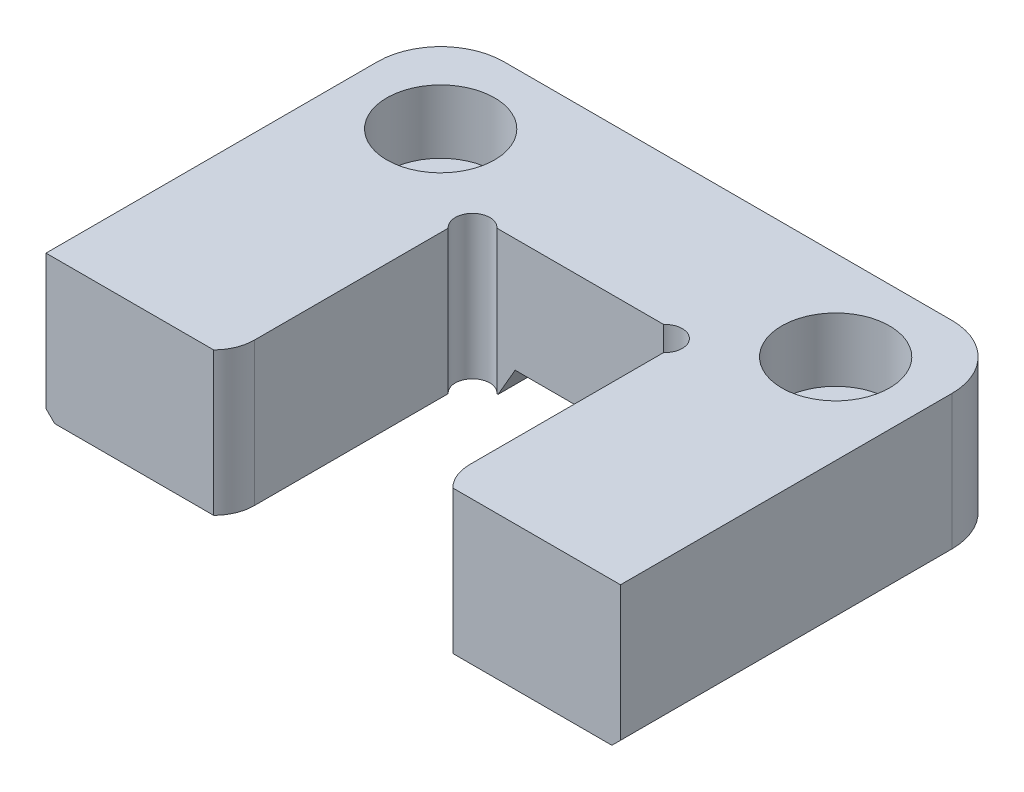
ISO-10303-21;
HEADER;
FILE_DESCRIPTION(('STEP AP214'),'2;1');
FILE_NAME('part.step','',(''),(''),'','','');
FILE_SCHEMA(('AUTOMOTIVE_DESIGN { 1 0 10303 214 1 1 1 1 }'));
ENDSEC;
DATA;
#1=APPLICATION_CONTEXT('core data for automotive mechanical design processes');
#2=APPLICATION_PROTOCOL_DEFINITION('international standard','automotive_design',2000,#1);
#3=PRODUCT_CONTEXT('',#1,'mechanical');
#4=PRODUCT('Part','Part','',(#3));
#5=PRODUCT_RELATED_PRODUCT_CATEGORY('part','',(#4));
#6=PRODUCT_DEFINITION_FORMATION('','',#4);
#7=PRODUCT_DEFINITION_CONTEXT('part definition',#1,'design');
#8=PRODUCT_DEFINITION('design','',#6,#7);
#9=PRODUCT_DEFINITION_SHAPE('','',#8);
#10=(LENGTH_UNIT() NAMED_UNIT(*) SI_UNIT(.MILLI.,.METRE.));
#11=(NAMED_UNIT(*) PLANE_ANGLE_UNIT() SI_UNIT($,.RADIAN.));
#12=(NAMED_UNIT(*) SI_UNIT($,.STERADIAN.) SOLID_ANGLE_UNIT());
#13=UNCERTAINTY_MEASURE_WITH_UNIT(LENGTH_MEASURE(1.E-05),#10,'distance_accuracy_value','');
#14=(GEOMETRIC_REPRESENTATION_CONTEXT(3) GLOBAL_UNCERTAINTY_ASSIGNED_CONTEXT((#13)) GLOBAL_UNIT_ASSIGNED_CONTEXT((#10,
#11,#12)) REPRESENTATION_CONTEXT('',''));
#15=CARTESIAN_POINT('',(0.,0.,0.));
#16=DIRECTION('',(0.,0.,1.));
#17=DIRECTION('',(1.,0.,0.));
#18=AXIS2_PLACEMENT_3D('',#15,#16,#17);
#19=CARTESIAN_POINT('',(-25.4,-12.6746,-34.8996));
#20=DIRECTION('',(0.,-1.,0.));
#21=DIRECTION('',(0.,0.,-1.));
#22=AXIS2_PLACEMENT_3D('',#19,#20,#21);
#23=PLANE('',#22);
#24=CARTESIAN_POINT('',(-17.4625,-12.6746,-26.9621));
#25=DIRECTION('',(0.,1.,0.));
#26=DIRECTION('',(0.,0.,1.));
#27=AXIS2_PLACEMENT_3D('',#24,#25,#26);
#28=CIRCLE('',#27,2.5527);
#29=CARTESIAN_POINT('',(-17.4625,-12.6746,-24.4094));
#30=VERTEX_POINT('',#29);
#31=EDGE_CURVE('E499',#30,#30,#28,.T.);
#32=ORIENTED_EDGE('',*,*,#31,.T.);
#33=EDGE_LOOP('',(#32));
#34=FACE_BOUND('',#33,.T.);
#35=CARTESIAN_POINT('',(-19.812,-12.6746,-29.3116));
#36=DIRECTION('',(0.,-1.,0.));
#37=DIRECTION('',(0.,0.,-1.));
#38=AXIS2_PLACEMENT_3D('',#35,#36,#37);
#39=CIRCLE('',#38,4.82599999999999);
#40=CARTESIAN_POINT('',(-24.638,-12.6746,-29.3116));
#41=VERTEX_POINT('',#40);
#42=CARTESIAN_POINT('',(-19.812,-12.6746,-34.1376));
#43=VERTEX_POINT('',#42);
#44=EDGE_CURVE('E343',#41,#43,#39,.T.);
#45=ORIENTED_EDGE('',*,*,#44,.T.);
#46=DIRECTION('',(1.,0.,0.));
#47=VECTOR('',#46,1.);
#48=CARTESIAN_POINT('',(-25.4,-12.6746,-34.1376));
#49=LINE('',#48,#47);
#50=CARTESIAN_POINT('',(-7.26654355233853,-12.6746,-34.1376));
#51=VERTEX_POINT('',#50);
#52=EDGE_CURVE('E345',#43,#51,#49,.T.);
#53=ORIENTED_EDGE('',*,*,#52,.T.);
#54=DIRECTION('',(0.,0.,-1.));
#55=VECTOR('',#54,1.);
#56=CARTESIAN_POINT('',(-7.26654355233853,-12.6746,-34.8996));
#57=LINE('',#56,#55);
#58=CARTESIAN_POINT('',(-7.26654355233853,-12.6746,-21.844));
#59=VERTEX_POINT('',#58);
#60=EDGE_CURVE('E320',#59,#51,#57,.T.);
#61=ORIENTED_EDGE('',*,*,#60,.F.);
#62=DIRECTION('',(1.,0.,0.));
#63=VECTOR('',#62,1.);
#64=CARTESIAN_POINT('',(-9.525,-12.6746,-21.844));
#65=LINE('',#64,#63);
#66=CARTESIAN_POINT('',(-7.37307746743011,-12.6746,-21.844));
#67=VERTEX_POINT('',#66);
#68=EDGE_CURVE('E271',#67,#59,#65,.T.);
#69=ORIENTED_EDGE('',*,*,#68,.F.);
#70=CARTESIAN_POINT('',(-8.509,-12.6746,-20.828));
#71=DIRECTION('',(0.,1.,0.));
#72=DIRECTION('',(0.,0.,1.));
#73=AXIS2_PLACEMENT_3D('',#70,#71,#72);
#74=CIRCLE('',#73,1.524);
#75=CARTESIAN_POINT('',(-9.525,-12.6746,-19.6920774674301));
#76=VERTEX_POINT('',#75);
#77=EDGE_CURVE('E233',#67,#76,#74,.T.);
#78=ORIENTED_EDGE('',*,*,#77,.T.);
#79=DIRECTION('',(0.,0.,-1.));
#80=VECTOR('',#79,1.);
#81=CARTESIAN_POINT('',(-9.525,-12.6746,0.));
#82=LINE('',#81,#80);
#83=CARTESIAN_POINT('',(-9.525,-12.6746,-2.54));
#84=VERTEX_POINT('',#83);
#85=EDGE_CURVE('E266',#84,#76,#82,.T.);
#86=ORIENTED_EDGE('',*,*,#85,.F.);
#87=CARTESIAN_POINT('',(-13.1163602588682,-12.6746,-2.54));
#88=DIRECTION('',(0.,-1.,0.));
#89=DIRECTION('',(0.,0.,1.));
#90=AXIS2_PLACEMENT_3D('',#87,#88,#89);
#91=CIRCLE('',#90,3.59136025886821);
#92=CARTESIAN_POINT('',(-10.577409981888,-12.6746,0.));
#93=VERTEX_POINT('',#92);
#94=EDGE_CURVE('E242',#84,#93,#91,.T.);
#95=ORIENTED_EDGE('',*,*,#94,.T.);
#96=DIRECTION('',(1.,0.,0.));
#97=VECTOR('',#96,1.);
#98=CARTESIAN_POINT('',(-25.4,-12.6746,0.));
#99=LINE('',#98,#97);
#100=CARTESIAN_POINT('',(-24.638,-12.6746,0.));
#101=VERTEX_POINT('',#100);
#102=EDGE_CURVE('E264',#101,#93,#99,.T.);
#103=ORIENTED_EDGE('',*,*,#102,.F.);
#104=DIRECTION('',(0.,0.,-1.));
#105=VECTOR('',#104,1.);
#106=CARTESIAN_POINT('',(-24.638,-12.6746,-34.8996));
#107=LINE('',#106,#105);
#108=EDGE_CURVE('E341',#101,#41,#107,.T.);
#109=ORIENTED_EDGE('',*,*,#108,.T.);
#110=EDGE_LOOP('',(#45,#53,#61,#69,#78,#86,#95,#103,#109));
#111=FACE_BOUND('',#110,.T.);
#112=ADVANCED_FACE('F35',(#34,#111),#23,.T.);
#113=CARTESIAN_POINT('',(-25.4,-12.6746,0.));
#114=DIRECTION('',(-1.,0.,0.));
#115=DIRECTION('',(0.,0.,1.));
#116=AXIS2_PLACEMENT_3D('',#113,#114,#115);
#117=PLANE('',#116);
#118=DIRECTION('',(0.,1.,0.));
#119=VECTOR('',#118,1.);
#120=CARTESIAN_POINT('',(-25.4,-12.6746,-29.3116));
#121=LINE('',#120,#119);
#122=CARTESIAN_POINT('',(-25.4,0.,-29.3116));
#123=VERTEX_POINT('',#122);
#124=CARTESIAN_POINT('',(-25.4,-11.9126,-29.3116));
#125=VERTEX_POINT('',#124);
#126=EDGE_CURVE('E312',#123,#125,#121,.F.);
#127=ORIENTED_EDGE('',*,*,#126,.T.);
#128=DIRECTION('',(0.,0.,1.));
#129=VECTOR('',#128,1.);
#130=CARTESIAN_POINT('',(-25.4,-11.9126,0.));
#131=LINE('',#130,#129);
#132=CARTESIAN_POINT('',(-25.4,-11.9126,0.));
#133=VERTEX_POINT('',#132);
#134=EDGE_CURVE('E350',#125,#133,#131,.T.);
#135=ORIENTED_EDGE('',*,*,#134,.T.);
#136=DIRECTION('',(0.,1.,0.));
#137=VECTOR('',#136,1.);
#138=CARTESIAN_POINT('',(-25.4,-12.6746,0.));
#139=LINE('',#138,#137);
#140=CARTESIAN_POINT('',(-25.4,0.,0.));
#141=VERTEX_POINT('',#140);
#142=EDGE_CURVE('E278',#133,#141,#139,.T.);
#143=ORIENTED_EDGE('',*,*,#142,.T.);
#144=DIRECTION('',(0.,0.,1.));
#145=VECTOR('',#144,1.);
#146=CARTESIAN_POINT('',(-25.4,0.,0.));
#147=LINE('',#146,#145);
#148=EDGE_CURVE('E256',#123,#141,#147,.T.);
#149=ORIENTED_EDGE('',*,*,#148,.F.);
#150=EDGE_LOOP('',(#127,#135,#143,#149));
#151=FACE_BOUND('',#150,.T.);
#152=ADVANCED_FACE('F425',(#151),#117,.T.);
#153=CARTESIAN_POINT('',(-25.4,-12.6746,-34.8996));
#154=DIRECTION('',(0.,0.,-1.));
#155=DIRECTION('',(-1.,0.,0.));
#156=AXIS2_PLACEMENT_3D('',#153,#154,#155);
#157=PLANE('',#156);
#158=DIRECTION('',(0.,1.,0.));
#159=VECTOR('',#158,1.);
#160=CARTESIAN_POINT('',(19.812,-12.6746,-34.8996));
#161=LINE('',#160,#159);
#162=CARTESIAN_POINT('',(19.812,0.,-34.8996));
#163=VERTEX_POINT('',#162);
#164=CARTESIAN_POINT('',(19.812,-11.9126,-34.8996));
#165=VERTEX_POINT('',#164);
#166=EDGE_CURVE('E310',#163,#165,#161,.F.);
#167=ORIENTED_EDGE('',*,*,#166,.T.);
#168=DIRECTION('',(-1.,0.,0.));
#169=VECTOR('',#168,1.);
#170=CARTESIAN_POINT('',(-25.4,-11.9126,-34.8996));
#171=LINE('',#170,#169);
#172=CARTESIAN_POINT('',(6.82660264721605,-11.9126,-34.8996));
#173=VERTEX_POINT('',#172);
#174=EDGE_CURVE('E335',#165,#173,#171,.T.);
#175=ORIENTED_EDGE('',*,*,#174,.T.);
#176=DIRECTION('',(0.499999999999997,-0.86602540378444,0.));
#177=VECTOR('',#176,1.);
#178=CARTESIAN_POINT('',(6.35,-11.0871,-34.8996));
#179=LINE('',#178,#177);
#180=CARTESIAN_POINT('',(6.35,-11.0871,-34.8996));
#181=VERTEX_POINT('',#180);
#182=EDGE_CURVE('E201',#181,#173,#179,.T.);
#183=ORIENTED_EDGE('',*,*,#182,.F.);
#184=DIRECTION('',(1.,0.,0.));
#185=VECTOR('',#184,1.);
#186=CARTESIAN_POINT('',(6.35,-11.0871,-34.8996));
#187=LINE('',#186,#185);
#188=CARTESIAN_POINT('',(-6.35,-11.0871,-34.8996));
#189=VERTEX_POINT('',#188);
#190=EDGE_CURVE('E195',#189,#181,#187,.T.);
#191=ORIENTED_EDGE('',*,*,#190,.F.);
#192=DIRECTION('',(0.499999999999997,0.86602540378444,0.));
#193=VECTOR('',#192,1.);
#194=CARTESIAN_POINT('',(-6.35,-11.0871,-34.8996));
#195=LINE('',#194,#193);
#196=CARTESIAN_POINT('',(-6.82660264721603,-11.9126,-34.8996));
#197=VERTEX_POINT('',#196);
#198=EDGE_CURVE('E204',#197,#189,#195,.T.);
#199=ORIENTED_EDGE('',*,*,#198,.F.);
#200=DIRECTION('',(-1.,0.,0.));
#201=VECTOR('',#200,1.);
#202=CARTESIAN_POINT('',(-25.4,-11.9126,-34.8996));
#203=LINE('',#202,#201);
#204=CARTESIAN_POINT('',(-19.812,-11.9126,-34.8996));
#205=VERTEX_POINT('',#204);
#206=EDGE_CURVE('E333',#197,#205,#203,.T.);
#207=ORIENTED_EDGE('',*,*,#206,.T.);
#208=DIRECTION('',(0.,1.,0.));
#209=VECTOR('',#208,1.);
#210=CARTESIAN_POINT('',(-19.812,-12.6746,-34.8996));
#211=LINE('',#210,#209);
#212=CARTESIAN_POINT('',(-19.812,0.,-34.8996));
#213=VERTEX_POINT('',#212);
#214=EDGE_CURVE('E308',#205,#213,#211,.T.);
#215=ORIENTED_EDGE('',*,*,#214,.T.);
#216=DIRECTION('',(-1.,0.,0.));
#217=VECTOR('',#216,1.);
#218=CARTESIAN_POINT('',(-25.4,0.,-34.8996));
#219=LINE('',#218,#217);
#220=EDGE_CURVE('E267',#163,#213,#219,.T.);
#221=ORIENTED_EDGE('',*,*,#220,.F.);
#222=EDGE_LOOP('',(#167,#175,#183,#191,#199,#207,#215,#221));
#223=FACE_BOUND('',#222,.T.);
#224=ADVANCED_FACE('F215',(#223),#157,.T.);
#225=CARTESIAN_POINT('',(25.4,-12.6746,0.));
#226=DIRECTION('',(1.,0.,0.));
#227=DIRECTION('',(0.,0.,-1.));
#228=AXIS2_PLACEMENT_3D('',#225,#226,#227);
#229=PLANE('',#228);
#230=DIRECTION('',(0.,1.,0.));
#231=VECTOR('',#230,1.);
#232=CARTESIAN_POINT('',(25.4,-12.6746,0.));
#233=LINE('',#232,#231);
#234=CARTESIAN_POINT('',(25.4,-11.9126,0.));
#235=VERTEX_POINT('',#234);
#236=CARTESIAN_POINT('',(25.4,0.,0.));
#237=VERTEX_POINT('',#236);
#238=EDGE_CURVE('E299',#235,#237,#233,.T.);
#239=ORIENTED_EDGE('',*,*,#238,.F.);
#240=DIRECTION('',(0.,0.,-1.));
#241=VECTOR('',#240,1.);
#242=CARTESIAN_POINT('',(25.4,-11.9126,0.));
#243=LINE('',#242,#241);
#244=CARTESIAN_POINT('',(25.4,-11.9126,-29.3116));
#245=VERTEX_POINT('',#244);
#246=EDGE_CURVE('E322',#235,#245,#243,.T.);
#247=ORIENTED_EDGE('',*,*,#246,.T.);
#248=DIRECTION('',(0.,1.,0.));
#249=VECTOR('',#248,1.);
#250=CARTESIAN_POINT('',(25.4,-12.6746,-29.3116));
#251=LINE('',#250,#249);
#252=CARTESIAN_POINT('',(25.4,0.,-29.3116));
#253=VERTEX_POINT('',#252);
#254=EDGE_CURVE('E301',#245,#253,#251,.T.);
#255=ORIENTED_EDGE('',*,*,#254,.T.);
#256=DIRECTION('',(0.,0.,-1.));
#257=VECTOR('',#256,1.);
#258=CARTESIAN_POINT('',(25.4,0.,0.));
#259=LINE('',#258,#257);
#260=EDGE_CURVE('E294',#237,#253,#259,.T.);
#261=ORIENTED_EDGE('',*,*,#260,.F.);
#262=EDGE_LOOP('',(#239,#247,#255,#261));
#263=FACE_BOUND('',#262,.T.);
#264=ADVANCED_FACE('F411',(#263),#229,.T.);
#265=CARTESIAN_POINT('',(9.525,-12.6746,0.));
#266=DIRECTION('',(0.,0.,1.));
#267=DIRECTION('',(1.,0.,0.));
#268=AXIS2_PLACEMENT_3D('',#265,#266,#267);
#269=PLANE('',#268);
#270=DIRECTION('',(1.,0.,0.));
#271=VECTOR('',#270,1.);
#272=CARTESIAN_POINT('',(9.525,-12.6746,0.));
#273=LINE('',#272,#271);
#274=CARTESIAN_POINT('',(10.577409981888,-12.6746,0.));
#275=VERTEX_POINT('',#274);
#276=CARTESIAN_POINT('',(24.638,-12.6746,0.));
#277=VERTEX_POINT('',#276);
#278=EDGE_CURVE('E275',#275,#277,#273,.T.);
#279=ORIENTED_EDGE('',*,*,#278,.T.);
#280=DIRECTION('',(-0.707106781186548,-0.707106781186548,0.));
#281=VECTOR('',#280,1.);
#282=CARTESIAN_POINT('',(17.0815,-20.2311,0.));
#283=LINE('',#282,#281);
#284=EDGE_CURVE('E331',#277,#235,#283,.F.);
#285=ORIENTED_EDGE('',*,*,#284,.T.);
#286=ORIENTED_EDGE('',*,*,#238,.T.);
#287=DIRECTION('',(1.,0.,0.));
#288=VECTOR('',#287,1.);
#289=CARTESIAN_POINT('',(9.525,0.,0.));
#290=LINE('',#289,#288);
#291=CARTESIAN_POINT('',(10.577409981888,0.,0.));
#292=VERTEX_POINT('',#291);
#293=EDGE_CURVE('E291',#292,#237,#290,.T.);
#294=ORIENTED_EDGE('',*,*,#293,.F.);
#295=DIRECTION('',(0.,1.,0.));
#296=VECTOR('',#295,1.);
#297=CARTESIAN_POINT('',(10.577409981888,-12.6746,0.));
#298=LINE('',#297,#296);
#299=EDGE_CURVE('E260',#275,#292,#298,.T.);
#300=ORIENTED_EDGE('',*,*,#299,.F.);
#301=EDGE_LOOP('',(#279,#285,#286,#294,#300));
#302=FACE_BOUND('',#301,.T.);
#303=ADVANCED_FACE('F394',(#302),#269,.T.);
#304=CARTESIAN_POINT('',(9.525,-12.6746,0.));
#305=DIRECTION('',(-1.,0.,0.));
#306=DIRECTION('',(0.,0.,1.));
#307=AXIS2_PLACEMENT_3D('',#304,#305,#306);
#308=PLANE('',#307);
#309=DIRECTION('',(0.,1.,0.));
#310=VECTOR('',#309,1.);
#311=CARTESIAN_POINT('',(9.525,-12.6746,-19.6920774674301));
#312=LINE('',#311,#310);
#313=CARTESIAN_POINT('',(9.525,-12.6746,-19.6920774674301));
#314=VERTEX_POINT('',#313);
#315=CARTESIAN_POINT('',(9.525,0.,-19.6920774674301));
#316=VERTEX_POINT('',#315);
#317=EDGE_CURVE('E230',#314,#316,#312,.T.);
#318=ORIENTED_EDGE('',*,*,#317,.F.);
#319=DIRECTION('',(0.,0.,1.));
#320=VECTOR('',#319,1.);
#321=CARTESIAN_POINT('',(9.525,-12.6746,0.));
#322=LINE('',#321,#320);
#323=CARTESIAN_POINT('',(9.525,-12.6746,-2.54));
#324=VERTEX_POINT('',#323);
#325=EDGE_CURVE('E273',#314,#324,#322,.T.);
#326=ORIENTED_EDGE('',*,*,#325,.T.);
#327=DIRECTION('',(0.,1.,0.));
#328=VECTOR('',#327,1.);
#329=CARTESIAN_POINT('',(9.525,-12.6746,-2.54));
#330=LINE('',#329,#328);
#331=CARTESIAN_POINT('',(9.525,0.,-2.54));
#332=VERTEX_POINT('',#331);
#333=EDGE_CURVE('E257',#324,#332,#330,.T.);
#334=ORIENTED_EDGE('',*,*,#333,.T.);
#335=DIRECTION('',(0.,0.,1.));
#336=VECTOR('',#335,1.);
#337=CARTESIAN_POINT('',(9.525,0.,0.));
#338=LINE('',#337,#336);
#339=EDGE_CURVE('E289',#316,#332,#338,.T.);
#340=ORIENTED_EDGE('',*,*,#339,.F.);
#341=EDGE_LOOP('',(#318,#326,#334,#340));
#342=FACE_BOUND('',#341,.T.);
#343=ADVANCED_FACE('F383',(#342),#308,.T.);
#344=CARTESIAN_POINT('',(-9.525,-12.6746,-21.844));
#345=DIRECTION('',(0.,0.,1.));
#346=DIRECTION('',(1.,0.,0.));
#347=AXIS2_PLACEMENT_3D('',#344,#345,#346);
#348=PLANE('',#347);
#349=DIRECTION('',(-0.499999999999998,-0.86602540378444,0.));
#350=VECTOR('',#349,1.);
#351=CARTESIAN_POINT('',(-7.83115766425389,-13.6525403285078,-21.844));
#352=LINE('',#351,#350);
#353=CARTESIAN_POINT('',(-5.76059094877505,-10.0662135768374,-21.844));
#354=VERTEX_POINT('',#353);
#355=EDGE_CURVE('E50',#354,#59,#352,.T.);
#356=ORIENTED_EDGE('',*,*,#355,.F.);
#357=DIRECTION('',(1.,0.,0.));
#358=VECTOR('',#357,1.);
#359=CARTESIAN_POINT('',(6.35,-10.0662135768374,-21.844));
#360=LINE('',#359,#358);
#361=CARTESIAN_POINT('',(5.76059094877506,-10.0662135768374,-21.844));
#362=VERTEX_POINT('',#361);
#363=EDGE_CURVE('E365',#354,#362,#360,.T.);
#364=ORIENTED_EDGE('',*,*,#363,.T.);
#365=DIRECTION('',(-0.499999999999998,0.86602540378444,0.));
#366=VECTOR('',#365,1.);
#367=CARTESIAN_POINT('',(3.06865766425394,-5.40364835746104,-21.844));
#368=LINE('',#367,#366);
#369=CARTESIAN_POINT('',(7.26654355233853,-12.6746,-21.844));
#370=VERTEX_POINT('',#369);
#371=EDGE_CURVE('E57',#370,#362,#368,.T.);
#372=ORIENTED_EDGE('',*,*,#371,.F.);
#373=CARTESIAN_POINT('',(7.37307746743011,-12.6746,-21.844));
#374=VERTEX_POINT('',#373);
#375=EDGE_CURVE('E270',#370,#374,#65,.T.);
#376=ORIENTED_EDGE('',*,*,#375,.T.);
#377=DIRECTION('',(0.,1.,0.));
#378=VECTOR('',#377,1.);
#379=CARTESIAN_POINT('',(7.37307746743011,-12.6746,-21.844));
#380=LINE('',#379,#378);
#381=CARTESIAN_POINT('',(7.37307746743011,0.,-21.844));
#382=VERTEX_POINT('',#381);
#383=EDGE_CURVE('E227',#382,#374,#380,.F.);
#384=ORIENTED_EDGE('',*,*,#383,.F.);
#385=DIRECTION('',(1.,0.,0.));
#386=VECTOR('',#385,1.);
#387=CARTESIAN_POINT('',(-9.525,0.,-21.844));
#388=LINE('',#387,#386);
#389=CARTESIAN_POINT('',(-7.37307746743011,0.,-21.844));
#390=VERTEX_POINT('',#389);
#391=EDGE_CURVE('E286',#390,#382,#388,.T.);
#392=ORIENTED_EDGE('',*,*,#391,.F.);
#393=DIRECTION('',(0.,1.,0.));
#394=VECTOR('',#393,1.);
#395=CARTESIAN_POINT('',(-7.37307746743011,-12.6746,-21.844));
#396=LINE('',#395,#394);
#397=EDGE_CURVE('E239',#67,#390,#396,.T.);
#398=ORIENTED_EDGE('',*,*,#397,.F.);
#399=ORIENTED_EDGE('',*,*,#68,.T.);
#400=EDGE_LOOP('',(#356,#364,#372,#376,#384,#392,#398,#399));
#401=FACE_BOUND('',#400,.T.);
#402=ADVANCED_FACE('F370',(#401),#348,.T.);
#403=CARTESIAN_POINT('',(-9.525,-12.6746,0.));
#404=DIRECTION('',(1.,0.,0.));
#405=DIRECTION('',(0.,0.,-1.));
#406=AXIS2_PLACEMENT_3D('',#403,#404,#405);
#407=PLANE('',#406);
#408=DIRECTION('',(0.,1.,0.));
#409=VECTOR('',#408,1.);
#410=CARTESIAN_POINT('',(-9.525,-12.6746,-19.6920774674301));
#411=LINE('',#410,#409);
#412=CARTESIAN_POINT('',(-9.525,0.,-19.6920774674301));
#413=VERTEX_POINT('',#412);
#414=EDGE_CURVE('E236',#413,#76,#411,.F.);
#415=ORIENTED_EDGE('',*,*,#414,.F.);
#416=DIRECTION('',(0.,0.,-1.));
#417=VECTOR('',#416,1.);
#418=CARTESIAN_POINT('',(-9.525,0.,0.));
#419=LINE('',#418,#417);
#420=CARTESIAN_POINT('',(-9.525,0.,-2.54));
#421=VERTEX_POINT('',#420);
#422=EDGE_CURVE('E283',#421,#413,#419,.T.);
#423=ORIENTED_EDGE('',*,*,#422,.F.);
#424=DIRECTION('',(0.,1.,0.));
#425=VECTOR('',#424,1.);
#426=CARTESIAN_POINT('',(-9.525,-12.6746,-2.54));
#427=LINE('',#426,#425);
#428=EDGE_CURVE('E254',#84,#421,#427,.T.);
#429=ORIENTED_EDGE('',*,*,#428,.F.);
#430=ORIENTED_EDGE('',*,*,#85,.T.);
#431=EDGE_LOOP('',(#415,#423,#429,#430));
#432=FACE_BOUND('',#431,.T.);
#433=ADVANCED_FACE('F449',(#432),#407,.T.);
#434=CARTESIAN_POINT('',(-25.4,-12.6746,0.));
#435=DIRECTION('',(0.,0.,1.));
#436=DIRECTION('',(1.,0.,0.));
#437=AXIS2_PLACEMENT_3D('',#434,#435,#436);
#438=PLANE('',#437);
#439=ORIENTED_EDGE('',*,*,#142,.F.);
#440=DIRECTION('',(-0.707106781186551,0.707106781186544,0.));
#441=VECTOR('',#440,1.);
#442=CARTESIAN_POINT('',(-25.019,-12.2936,0.));
#443=LINE('',#442,#441);
#444=EDGE_CURVE('E352',#133,#101,#443,.F.);
#445=ORIENTED_EDGE('',*,*,#444,.T.);
#446=ORIENTED_EDGE('',*,*,#102,.T.);
#447=DIRECTION('',(0.,1.,0.));
#448=VECTOR('',#447,1.);
#449=CARTESIAN_POINT('',(-10.577409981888,-12.6746,0.));
#450=LINE('',#449,#448);
#451=CARTESIAN_POINT('',(-10.577409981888,0.,0.));
#452=VERTEX_POINT('',#451);
#453=EDGE_CURVE('E249',#93,#452,#450,.T.);
#454=ORIENTED_EDGE('',*,*,#453,.T.);
#455=DIRECTION('',(1.,0.,0.));
#456=VECTOR('',#455,1.);
#457=CARTESIAN_POINT('',(-25.4,0.,0.));
#458=LINE('',#457,#456);
#459=EDGE_CURVE('E281',#141,#452,#458,.T.);
#460=ORIENTED_EDGE('',*,*,#459,.F.);
#461=EDGE_LOOP('',(#439,#445,#446,#454,#460));
#462=FACE_BOUND('',#461,.T.);
#463=ADVANCED_FACE('F430',(#462),#438,.T.);
#464=CARTESIAN_POINT('',(17.4625,-12.6746,-26.9621));
#465=DIRECTION('',(0.,1.,0.));
#466=DIRECTION('',(0.,0.,1.));
#467=AXIS2_PLACEMENT_3D('',#464,#465,#466);
#468=CIRCLE('',#467,2.5527);
#469=CARTESIAN_POINT('',(17.4625,-12.6746,-24.4094));
#470=VERTEX_POINT('',#469);
#471=EDGE_CURVE('E361',#470,#470,#468,.T.);
#472=ORIENTED_EDGE('',*,*,#471,.T.);
#473=EDGE_LOOP('',(#472));
#474=FACE_BOUND('',#473,.T.);
#475=CARTESIAN_POINT('',(19.812,-12.6746,-29.3116));
#476=DIRECTION('',(0.,-1.,0.));
#477=DIRECTION('',(0.,0.,-1.));
#478=AXIS2_PLACEMENT_3D('',#475,#476,#477);
#479=CIRCLE('',#478,4.82600000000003);
#480=CARTESIAN_POINT('',(19.812,-12.6746,-34.1376));
#481=VERTEX_POINT('',#480);
#482=CARTESIAN_POINT('',(24.638,-12.6746,-29.3116));
#483=VERTEX_POINT('',#482);
#484=EDGE_CURVE('E325',#481,#483,#479,.T.);
#485=ORIENTED_EDGE('',*,*,#484,.T.);
#486=DIRECTION('',(0.,0.,1.));
#487=VECTOR('',#486,1.);
#488=CARTESIAN_POINT('',(24.638,-12.6746,-34.8996));
#489=LINE('',#488,#487);
#490=EDGE_CURVE('E329',#483,#277,#489,.T.);
#491=ORIENTED_EDGE('',*,*,#490,.T.);
#492=ORIENTED_EDGE('',*,*,#278,.F.);
#493=CARTESIAN_POINT('',(13.1163602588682,-12.6746,-2.54));
#494=DIRECTION('',(0.,-1.,0.));
#495=DIRECTION('',(0.,0.,-1.));
#496=AXIS2_PLACEMENT_3D('',#493,#494,#495);
#497=CIRCLE('',#496,3.59136025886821);
#498=EDGE_CURVE('E245',#275,#324,#497,.T.);
#499=ORIENTED_EDGE('',*,*,#498,.T.);
#500=ORIENTED_EDGE('',*,*,#325,.F.);
#501=CARTESIAN_POINT('',(8.509,-12.6746,-20.828));
#502=DIRECTION('',(0.,1.,0.));
#503=DIRECTION('',(0.,0.,-1.));
#504=AXIS2_PLACEMENT_3D('',#501,#502,#503);
#505=CIRCLE('',#504,1.524);
#506=EDGE_CURVE('E224',#314,#374,#505,.T.);
#507=ORIENTED_EDGE('',*,*,#506,.T.);
#508=ORIENTED_EDGE('',*,*,#375,.F.);
#509=DIRECTION('',(0.,0.,1.));
#510=VECTOR('',#509,1.);
#511=CARTESIAN_POINT('',(7.26654355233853,-12.6746,-34.8996));
#512=LINE('',#511,#510);
#513=CARTESIAN_POINT('',(7.26654355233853,-12.6746,-34.1376));
#514=VERTEX_POINT('',#513);
#515=EDGE_CURVE('E318',#514,#370,#512,.T.);
#516=ORIENTED_EDGE('',*,*,#515,.F.);
#517=DIRECTION('',(1.,0.,0.));
#518=VECTOR('',#517,1.);
#519=CARTESIAN_POINT('',(-25.4,-12.6746,-34.1376));
#520=LINE('',#519,#518);
#521=EDGE_CURVE('E327',#514,#481,#520,.T.);
#522=ORIENTED_EDGE('',*,*,#521,.T.);
#523=EDGE_LOOP('',(#485,#491,#492,#499,#500,#507,#508,#516,#522));
#524=FACE_BOUND('',#523,.T.);
#525=ADVANCED_FACE('F375',(#474,#524),#23,.T.);
#526=CARTESIAN_POINT('',(-25.4,0.,-34.8996));
#527=DIRECTION('',(0.,-1.,0.));
#528=DIRECTION('',(0.,0.,-1.));
#529=AXIS2_PLACEMENT_3D('',#526,#527,#528);
#530=PLANE('',#529);
#531=CARTESIAN_POINT('',(-17.4625,0.,-26.9621));
#532=DIRECTION('',(0.,1.,0.));
#533=DIRECTION('',(0.,0.,1.));
#534=AXIS2_PLACEMENT_3D('',#531,#532,#533);
#535=CIRCLE('',#534,4.7625);
#536=CARTESIAN_POINT('',(-17.4625,0.,-22.1996));
#537=VERTEX_POINT('',#536);
#538=EDGE_CURVE('E507',#537,#537,#535,.T.);
#539=ORIENTED_EDGE('',*,*,#538,.F.);
#540=EDGE_LOOP('',(#539));
#541=FACE_BOUND('',#540,.T.);
#542=CARTESIAN_POINT('',(17.4625,0.,-26.9621));
#543=DIRECTION('',(0.,1.,0.));
#544=DIRECTION('',(0.,0.,1.));
#545=AXIS2_PLACEMENT_3D('',#542,#543,#544);
#546=CIRCLE('',#545,4.7625);
#547=CARTESIAN_POINT('',(17.4625,0.,-22.1996));
#548=VERTEX_POINT('',#547);
#549=EDGE_CURVE('E496',#548,#548,#546,.T.);
#550=ORIENTED_EDGE('',*,*,#549,.F.);
#551=EDGE_LOOP('',(#550));
#552=FACE_BOUND('',#551,.T.);
#553=ORIENTED_EDGE('',*,*,#391,.T.);
#554=CARTESIAN_POINT('',(8.509,0.,-20.828));
#555=DIRECTION('',(0.,-1.,0.));
#556=DIRECTION('',(0.,0.,-1.));
#557=AXIS2_PLACEMENT_3D('',#554,#555,#556);
#558=CIRCLE('',#557,1.524);
#559=EDGE_CURVE('E315',#382,#316,#558,.T.);
#560=ORIENTED_EDGE('',*,*,#559,.T.);
#561=ORIENTED_EDGE('',*,*,#339,.T.);
#562=CARTESIAN_POINT('',(13.1163602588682,0.,-2.54));
#563=DIRECTION('',(0.,-1.,0.));
#564=DIRECTION('',(0.,0.,-1.));
#565=AXIS2_PLACEMENT_3D('',#562,#563,#564);
#566=CIRCLE('',#565,3.59136025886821);
#567=EDGE_CURVE('E246',#292,#332,#566,.T.);
#568=ORIENTED_EDGE('',*,*,#567,.F.);
#569=ORIENTED_EDGE('',*,*,#293,.T.);
#570=ORIENTED_EDGE('',*,*,#260,.T.);
#571=CARTESIAN_POINT('',(19.812,0.,-29.3116));
#572=DIRECTION('',(0.,-1.,0.));
#573=DIRECTION('',(0.,0.,-1.));
#574=AXIS2_PLACEMENT_3D('',#571,#572,#573);
#575=CIRCLE('',#574,5.588);
#576=EDGE_CURVE('E306',#253,#163,#575,.F.);
#577=ORIENTED_EDGE('',*,*,#576,.T.);
#578=ORIENTED_EDGE('',*,*,#220,.T.);
#579=CARTESIAN_POINT('',(-19.812,0.,-29.3116));
#580=DIRECTION('',(0.,-1.,0.));
#581=DIRECTION('',(0.,0.,-1.));
#582=AXIS2_PLACEMENT_3D('',#579,#580,#581);
#583=CIRCLE('',#582,5.588);
#584=EDGE_CURVE('E304',#213,#123,#583,.F.);
#585=ORIENTED_EDGE('',*,*,#584,.T.);
#586=ORIENTED_EDGE('',*,*,#148,.T.);
#587=ORIENTED_EDGE('',*,*,#459,.T.);
#588=CARTESIAN_POINT('',(-13.1163602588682,0.,-2.54));
#589=DIRECTION('',(0.,-1.,0.));
#590=DIRECTION('',(0.,0.,1.));
#591=AXIS2_PLACEMENT_3D('',#588,#589,#590);
#592=CIRCLE('',#591,3.59136025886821);
#593=EDGE_CURVE('E241',#421,#452,#592,.T.);
#594=ORIENTED_EDGE('',*,*,#593,.F.);
#595=ORIENTED_EDGE('',*,*,#422,.T.);
#596=CARTESIAN_POINT('',(-8.509,0.,-20.828));
#597=DIRECTION('',(0.,1.,0.));
#598=DIRECTION('',(0.,0.,1.));
#599=AXIS2_PLACEMENT_3D('',#596,#597,#598);
#600=CIRCLE('',#599,1.524);
#601=EDGE_CURVE('E232',#390,#413,#600,.T.);
#602=ORIENTED_EDGE('',*,*,#601,.F.);
#603=EDGE_LOOP('',(#553,#560,#561,#568,#569,#570,#577,#578,#585,#586,#587,#594,#595,#602));
#604=FACE_BOUND('',#603,.T.);
#605=ADVANCED_FACE('F387',(#541,#552,#604),#530,.F.);
#606=CARTESIAN_POINT('',(19.812,-12.6746,-29.3116));
#607=DIRECTION('',(0.,1.,0.));
#608=DIRECTION('',(0.,0.,1.));
#609=AXIS2_PLACEMENT_3D('',#606,#607,#608);
#610=CYLINDRICAL_SURFACE('',#609,5.588);
#611=ORIENTED_EDGE('',*,*,#254,.F.);
#612=CARTESIAN_POINT('',(19.812,-11.9126,-29.3116));
#613=DIRECTION('',(0.,-1.,0.));
#614=DIRECTION('',(0.,0.,-1.));
#615=AXIS2_PLACEMENT_3D('',#612,#613,#614);
#616=CIRCLE('',#615,5.588);
#617=EDGE_CURVE('E339',#245,#165,#616,.F.);
#618=ORIENTED_EDGE('',*,*,#617,.T.);
#619=ORIENTED_EDGE('',*,*,#166,.F.);
#620=ORIENTED_EDGE('',*,*,#576,.F.);
#621=EDGE_LOOP('',(#611,#618,#619,#620));
#622=FACE_BOUND('',#621,.T.);
#623=ADVANCED_FACE('F414',(#622),#610,.T.);
#624=CARTESIAN_POINT('',(-19.812,-12.6746,-29.3116));
#625=DIRECTION('',(0.,1.,0.));
#626=DIRECTION('',(0.,0.,1.));
#627=AXIS2_PLACEMENT_3D('',#624,#625,#626);
#628=CYLINDRICAL_SURFACE('',#627,5.588);
#629=ORIENTED_EDGE('',*,*,#214,.F.);
#630=CARTESIAN_POINT('',(-19.812,-11.9126,-29.3116));
#631=DIRECTION('',(0.,-1.,0.));
#632=DIRECTION('',(0.,0.,-1.));
#633=AXIS2_PLACEMENT_3D('',#630,#631,#632);
#634=CIRCLE('',#633,5.588);
#635=EDGE_CURVE('E348',#205,#125,#634,.F.);
#636=ORIENTED_EDGE('',*,*,#635,.T.);
#637=ORIENTED_EDGE('',*,*,#126,.F.);
#638=ORIENTED_EDGE('',*,*,#584,.F.);
#639=EDGE_LOOP('',(#629,#636,#637,#638));
#640=FACE_BOUND('',#639,.T.);
#641=ADVANCED_FACE('F421',(#640),#628,.T.);
#642=CARTESIAN_POINT('',(13.1163602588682,-12.6746,-2.54));
#643=DIRECTION('',(0.,1.,0.));
#644=DIRECTION('',(0.,0.,1.));
#645=AXIS2_PLACEMENT_3D('',#642,#643,#644);
#646=CYLINDRICAL_SURFACE('',#645,3.59136025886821);
#647=ORIENTED_EDGE('',*,*,#567,.T.);
#648=ORIENTED_EDGE('',*,*,#333,.F.);
#649=ORIENTED_EDGE('',*,*,#498,.F.);
#650=ORIENTED_EDGE('',*,*,#299,.T.);
#651=EDGE_LOOP('',(#647,#648,#649,#650));
#652=FACE_BOUND('',#651,.T.);
#653=ADVANCED_FACE('F390',(#652),#646,.T.);
#654=CARTESIAN_POINT('',(-13.1163602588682,-12.6746,-2.54));
#655=DIRECTION('',(0.,1.,0.));
#656=DIRECTION('',(0.,0.,1.));
#657=AXIS2_PLACEMENT_3D('',#654,#655,#656);
#658=CYLINDRICAL_SURFACE('',#657,3.59136025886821);
#659=ORIENTED_EDGE('',*,*,#593,.T.);
#660=ORIENTED_EDGE('',*,*,#453,.F.);
#661=ORIENTED_EDGE('',*,*,#94,.F.);
#662=ORIENTED_EDGE('',*,*,#428,.T.);
#663=EDGE_LOOP('',(#659,#660,#661,#662));
#664=FACE_BOUND('',#663,.T.);
#665=ADVANCED_FACE('F442',(#664),#658,.T.);
#666=CARTESIAN_POINT('',(-8.509,-12.6746,-20.828));
#667=DIRECTION('',(0.,1.,0.));
#668=DIRECTION('',(0.,0.,1.));
#669=AXIS2_PLACEMENT_3D('',#666,#667,#668);
#670=CYLINDRICAL_SURFACE('',#669,1.524);
#671=ORIENTED_EDGE('',*,*,#397,.T.);
#672=ORIENTED_EDGE('',*,*,#601,.T.);
#673=ORIENTED_EDGE('',*,*,#414,.T.);
#674=ORIENTED_EDGE('',*,*,#77,.F.);
#675=EDGE_LOOP('',(#671,#672,#673,#674));
#676=FACE_BOUND('',#675,.T.);
#677=ADVANCED_FACE('F451',(#676),#670,.F.);
#678=CARTESIAN_POINT('',(8.509,-12.6746,-20.828));
#679=DIRECTION('',(0.,1.,0.));
#680=DIRECTION('',(0.,0.,1.));
#681=AXIS2_PLACEMENT_3D('',#678,#679,#680);
#682=CYLINDRICAL_SURFACE('',#681,1.524);
#683=ORIENTED_EDGE('',*,*,#317,.T.);
#684=ORIENTED_EDGE('',*,*,#559,.F.);
#685=ORIENTED_EDGE('',*,*,#383,.T.);
#686=ORIENTED_EDGE('',*,*,#506,.F.);
#687=EDGE_LOOP('',(#683,#684,#685,#686));
#688=FACE_BOUND('',#687,.T.);
#689=ADVANCED_FACE('F380',(#688),#682,.F.);
#690=CARTESIAN_POINT('',(-6.35,-11.0871,0.));
#691=DIRECTION('',(-0.86602540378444,0.499999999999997,0.));
#692=DIRECTION('',(-0.499999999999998,-0.86602540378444,0.));
#693=AXIS2_PLACEMENT_3D('',#690,#691,#692);
#694=PLANE('',#693);
#695=ORIENTED_EDGE('',*,*,#60,.T.);
#696=DIRECTION('',(-0.377964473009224,-0.654653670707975,0.654653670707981));
#697=VECTOR('',#696,1.);
#698=CARTESIAN_POINT('',(-9.47994512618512,-16.5083239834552,-30.3038760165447));
#699=LINE('',#698,#697);
#700=EDGE_CURVE('E208',#51,#197,#699,.F.);
#701=ORIENTED_EDGE('',*,*,#700,.T.);
#702=ORIENTED_EDGE('',*,*,#198,.T.);
#703=DIRECTION('',(0.,0.,-1.));
#704=VECTOR('',#703,1.);
#705=CARTESIAN_POINT('',(-6.35,-11.0871,0.));
#706=LINE('',#705,#704);
#707=CARTESIAN_POINT('',(-6.35,-11.0871,-25.654));
#708=VERTEX_POINT('',#707);
#709=EDGE_CURVE('E190',#708,#189,#706,.T.);
#710=ORIENTED_EDGE('',*,*,#709,.F.);
#711=DIRECTION('',(0.147788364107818,0.255976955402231,0.955319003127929));
#712=VECTOR('',#711,1.);
#713=CARTESIAN_POINT('',(-2.7280391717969,-4.81367982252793,-2.24127716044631));
#714=LINE('',#713,#712);
#715=EDGE_CURVE('E43',#708,#354,#714,.T.);
#716=ORIENTED_EDGE('',*,*,#715,.T.);
#717=ORIENTED_EDGE('',*,*,#355,.T.);
#718=EDGE_LOOP('',(#695,#701,#702,#710,#716,#717));
#719=FACE_BOUND('',#718,.T.);
#720=ADVANCED_FACE('F206',(#719),#694,.F.);
#721=CARTESIAN_POINT('',(6.35,-11.0871,0.));
#722=DIRECTION('',(0.86602540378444,0.499999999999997,0.));
#723=DIRECTION('',(-0.499999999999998,0.86602540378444,0.));
#724=AXIS2_PLACEMENT_3D('',#721,#722,#723);
#725=PLANE('',#724);
#726=ORIENTED_EDGE('',*,*,#182,.T.);
#727=DIRECTION('',(-0.377964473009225,0.654653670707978,-0.654653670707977));
#728=VECTOR('',#727,1.);
#729=CARTESIAN_POINT('',(2.22280226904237,-3.93858383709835,-42.8736161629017));
#730=LINE('',#729,#728);
#731=EDGE_CURVE('E337',#173,#514,#730,.F.);
#732=ORIENTED_EDGE('',*,*,#731,.T.);
#733=ORIENTED_EDGE('',*,*,#515,.T.);
#734=ORIENTED_EDGE('',*,*,#371,.T.);
#735=DIRECTION('',(0.147788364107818,-0.255976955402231,-0.955319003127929));
#736=VECTOR('',#735,1.);
#737=CARTESIAN_POINT('',(2.7280391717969,-4.81367982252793,-2.24127716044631));
#738=LINE('',#737,#736);
#739=CARTESIAN_POINT('',(6.35,-11.0871,-25.654));
#740=VERTEX_POINT('',#739);
#741=EDGE_CURVE('E11',#362,#740,#738,.T.);
#742=ORIENTED_EDGE('',*,*,#741,.T.);
#743=DIRECTION('',(0.,0.,-1.));
#744=VECTOR('',#743,1.);
#745=CARTESIAN_POINT('',(6.35,-11.0871,0.));
#746=LINE('',#745,#744);
#747=EDGE_CURVE('E200',#740,#181,#746,.T.);
#748=ORIENTED_EDGE('',*,*,#747,.T.);
#749=EDGE_LOOP('',(#726,#732,#733,#734,#742,#748));
#750=FACE_BOUND('',#749,.T.);
#751=ADVANCED_FACE('F536',(#750),#725,.F.);
#752=CARTESIAN_POINT('',(6.35,-11.0871,0.));
#753=DIRECTION('',(0.,1.,0.));
#754=DIRECTION('',(0.,0.,1.));
#755=AXIS2_PLACEMENT_3D('',#752,#753,#754);
#756=PLANE('',#755);
#757=ORIENTED_EDGE('',*,*,#747,.F.);
#758=DIRECTION('',(-1.,0.,0.));
#759=VECTOR('',#758,1.);
#760=CARTESIAN_POINT('',(-6.35,-11.0871,-25.654));
#761=LINE('',#760,#759);
#762=EDGE_CURVE('E198',#740,#708,#761,.T.);
#763=ORIENTED_EDGE('',*,*,#762,.T.);
#764=ORIENTED_EDGE('',*,*,#709,.T.);
#765=ORIENTED_EDGE('',*,*,#190,.T.);
#766=EDGE_LOOP('',(#757,#763,#764,#765));
#767=FACE_BOUND('',#766,.T.);
#768=ADVANCED_FACE('F193',(#767),#756,.F.);
#769=CARTESIAN_POINT('',(-25.4,-11.9126,-34.8996));
#770=DIRECTION('',(0.,0.707106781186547,0.707106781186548));
#771=DIRECTION('',(0.,-0.707106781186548,0.707106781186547));
#772=AXIS2_PLACEMENT_3D('',#769,#770,#771);
#773=PLANE('',#772);
#774=ORIENTED_EDGE('',*,*,#731,.F.);
#775=ORIENTED_EDGE('',*,*,#174,.F.);
#776=DIRECTION('',(0.,0.707106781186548,-0.707106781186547));
#777=VECTOR('',#776,1.);
#778=CARTESIAN_POINT('',(19.812,-12.6746,-34.1376));
#779=LINE('',#778,#777);
#780=EDGE_CURVE('E212',#481,#165,#779,.T.);
#781=ORIENTED_EDGE('',*,*,#780,.F.);
#782=ORIENTED_EDGE('',*,*,#521,.F.);
#783=EDGE_LOOP('',(#774,#775,#781,#782));
#784=FACE_BOUND('',#783,.T.);
#785=ADVANCED_FACE('F541',(#784),#773,.F.);
#786=CARTESIAN_POINT('',(19.812,-12.6746,-29.3116));
#787=DIRECTION('',(0.,1.,0.));
#788=DIRECTION('',(0.,0.,1.));
#789=AXIS2_PLACEMENT_3D('',#786,#787,#788);
#790=CONICAL_SURFACE('',#789,4.82600000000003,0.78539816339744);
#791=ORIENTED_EDGE('',*,*,#780,.T.);
#792=ORIENTED_EDGE('',*,*,#617,.F.);
#793=DIRECTION('',(0.707106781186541,0.707106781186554,0.));
#794=VECTOR('',#793,1.);
#795=CARTESIAN_POINT('',(24.638,-12.6746,-29.3116));
#796=LINE('',#795,#794);
#797=EDGE_CURVE('E354',#483,#245,#796,.T.);
#798=ORIENTED_EDGE('',*,*,#797,.F.);
#799=ORIENTED_EDGE('',*,*,#484,.F.);
#800=EDGE_LOOP('',(#791,#792,#798,#799));
#801=FACE_BOUND('',#800,.T.);
#802=ADVANCED_FACE('F404',(#801),#790,.T.);
#803=CARTESIAN_POINT('',(25.4,-11.9126,0.));
#804=DIRECTION('',(-0.707106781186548,0.707106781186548,0.));
#805=DIRECTION('',(-0.707106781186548,-0.707106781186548,0.));
#806=AXIS2_PLACEMENT_3D('',#803,#804,#805);
#807=PLANE('',#806);
#808=ORIENTED_EDGE('',*,*,#284,.F.);
#809=ORIENTED_EDGE('',*,*,#490,.F.);
#810=ORIENTED_EDGE('',*,*,#797,.T.);
#811=ORIENTED_EDGE('',*,*,#246,.F.);
#812=EDGE_LOOP('',(#808,#809,#810,#811));
#813=FACE_BOUND('',#812,.T.);
#814=ADVANCED_FACE('F400',(#813),#807,.F.);
#815=CARTESIAN_POINT('',(-25.4,-11.9126,0.));
#816=DIRECTION('',(0.707106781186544,0.707106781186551,0.));
#817=DIRECTION('',(-0.707106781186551,0.707106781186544,0.));
#818=AXIS2_PLACEMENT_3D('',#815,#816,#817);
#819=PLANE('',#818);
#820=ORIENTED_EDGE('',*,*,#444,.F.);
#821=ORIENTED_EDGE('',*,*,#134,.F.);
#822=DIRECTION('',(-0.707106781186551,0.707106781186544,0.));
#823=VECTOR('',#822,1.);
#824=CARTESIAN_POINT('',(-24.638,-12.6746,-29.3116));
#825=LINE('',#824,#823);
#826=EDGE_CURVE('E356',#41,#125,#825,.T.);
#827=ORIENTED_EDGE('',*,*,#826,.F.);
#828=ORIENTED_EDGE('',*,*,#108,.F.);
#829=EDGE_LOOP('',(#820,#821,#827,#828));
#830=FACE_BOUND('',#829,.T.);
#831=ADVANCED_FACE('F434',(#830),#819,.F.);
#832=CARTESIAN_POINT('',(-19.812,-12.6746,-29.3116));
#833=DIRECTION('',(0.,1.,0.));
#834=DIRECTION('',(0.,0.,1.));
#835=AXIS2_PLACEMENT_3D('',#832,#833,#834);
#836=CONICAL_SURFACE('',#835,4.82599999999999,0.785398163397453);
#837=ORIENTED_EDGE('',*,*,#826,.T.);
#838=ORIENTED_EDGE('',*,*,#635,.F.);
#839=DIRECTION('',(0.,0.707106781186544,-0.707106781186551));
#840=VECTOR('',#839,1.);
#841=CARTESIAN_POINT('',(-19.812,-12.6746,-34.1376));
#842=LINE('',#841,#840);
#843=EDGE_CURVE('E359',#43,#205,#842,.T.);
#844=ORIENTED_EDGE('',*,*,#843,.F.);
#845=ORIENTED_EDGE('',*,*,#44,.F.);
#846=EDGE_LOOP('',(#837,#838,#844,#845));
#847=FACE_BOUND('',#846,.T.);
#848=ADVANCED_FACE('F460',(#847),#836,.T.);
#849=CARTESIAN_POINT('',(-25.4,-11.9126,-34.8996));
#850=DIRECTION('',(0.,0.707106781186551,0.707106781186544));
#851=DIRECTION('',(0.,-0.707106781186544,0.707106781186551));
#852=AXIS2_PLACEMENT_3D('',#849,#850,#851);
#853=PLANE('',#852);
#854=ORIENTED_EDGE('',*,*,#700,.F.);
#855=ORIENTED_EDGE('',*,*,#52,.F.);
#856=ORIENTED_EDGE('',*,*,#843,.T.);
#857=ORIENTED_EDGE('',*,*,#206,.F.);
#858=EDGE_LOOP('',(#854,#855,#856,#857));
#859=FACE_BOUND('',#858,.T.);
#860=ADVANCED_FACE('F456',(#859),#853,.F.);
#861=CARTESIAN_POINT('',(6.35,-11.0871,-25.654));
#862=DIRECTION('',(0.,-0.965925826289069,0.258819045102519));
#863=DIRECTION('',(0.,-0.258819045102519,-0.965925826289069));
#864=AXIS2_PLACEMENT_3D('',#861,#862,#863);
#865=PLANE('',#864);
#866=ORIENTED_EDGE('',*,*,#741,.F.);
#867=ORIENTED_EDGE('',*,*,#363,.F.);
#868=ORIENTED_EDGE('',*,*,#715,.F.);
#869=ORIENTED_EDGE('',*,*,#762,.F.);
#870=EDGE_LOOP('',(#866,#867,#868,#869));
#871=FACE_BOUND('',#870,.T.);
#872=ADVANCED_FACE('F37',(#871),#865,.T.);
#873=CARTESIAN_POINT('',(17.4625,0.,-26.9621));
#874=DIRECTION('',(0.,1.,0.));
#875=DIRECTION('',(0.,0.,1.));
#876=AXIS2_PLACEMENT_3D('',#873,#874,#875);
#877=CYLINDRICAL_SURFACE('',#876,2.5527);
#878=ORIENTED_EDGE('',*,*,#471,.F.);
#879=EDGE_LOOP('',(#878));
#880=FACE_BOUND('',#879,.T.);
#881=CARTESIAN_POINT('',(17.4625,-5.61975,-26.9621));
#882=DIRECTION('',(0.,1.,0.));
#883=DIRECTION('',(0.,0.,1.));
#884=AXIS2_PLACEMENT_3D('',#881,#882,#883);
#885=CIRCLE('',#884,2.5527);
#886=CARTESIAN_POINT('',(17.4625,-5.61975,-24.4094));
#887=VERTEX_POINT('',#886);
#888=EDGE_CURVE('E489',#887,#887,#885,.T.);
#889=ORIENTED_EDGE('',*,*,#888,.T.);
#890=EDGE_LOOP('',(#889));
#891=FACE_BOUND('',#890,.T.);
#892=ADVANCED_FACE('F528',(#880,#891),#877,.F.);
#893=CARTESIAN_POINT('',(20.0152,-5.61975,-26.9621));
#894=DIRECTION('',(0.,-1.,0.));
#895=DIRECTION('',(0.,0.,-1.));
#896=AXIS2_PLACEMENT_3D('',#893,#894,#895);
#897=PLANE('',#896);
#898=ORIENTED_EDGE('',*,*,#888,.F.);
#899=EDGE_LOOP('',(#898));
#900=FACE_BOUND('',#899,.T.);
#901=CARTESIAN_POINT('',(17.4625,-5.61975,-26.9621));
#902=DIRECTION('',(0.,1.,0.));
#903=DIRECTION('',(0.,0.,1.));
#904=AXIS2_PLACEMENT_3D('',#901,#902,#903);
#905=CIRCLE('',#904,4.7625);
#906=CARTESIAN_POINT('',(17.4625,-5.61975,-22.1996));
#907=VERTEX_POINT('',#906);
#908=EDGE_CURVE('E491',#907,#907,#905,.T.);
#909=ORIENTED_EDGE('',*,*,#908,.T.);
#910=EDGE_LOOP('',(#909));
#911=FACE_BOUND('',#910,.T.);
#912=ADVANCED_FACE('F518',(#900,#911),#897,.F.);
#913=CARTESIAN_POINT('',(17.4625,0.,-26.9621));
#914=DIRECTION('',(0.,1.,0.));
#915=DIRECTION('',(0.,0.,1.));
#916=AXIS2_PLACEMENT_3D('',#913,#914,#915);
#917=CYLINDRICAL_SURFACE('',#916,4.7625);
#918=ORIENTED_EDGE('',*,*,#908,.F.);
#919=EDGE_LOOP('',(#918));
#920=FACE_BOUND('',#919,.T.);
#921=ORIENTED_EDGE('',*,*,#549,.T.);
#922=EDGE_LOOP('',(#921));
#923=FACE_BOUND('',#922,.T.);
#924=ADVANCED_FACE('F515',(#920,#923),#917,.F.);
#925=CARTESIAN_POINT('',(-17.4625,0.,-26.9621));
#926=DIRECTION('',(0.,1.,0.));
#927=DIRECTION('',(0.,0.,1.));
#928=AXIS2_PLACEMENT_3D('',#925,#926,#927);
#929=CYLINDRICAL_SURFACE('',#928,2.5527);
#930=ORIENTED_EDGE('',*,*,#31,.F.);
#931=EDGE_LOOP('',(#930));
#932=FACE_BOUND('',#931,.T.);
#933=CARTESIAN_POINT('',(-17.4625,-5.61975,-26.9621));
#934=DIRECTION('',(0.,1.,0.));
#935=DIRECTION('',(0.,0.,1.));
#936=AXIS2_PLACEMENT_3D('',#933,#934,#935);
#937=CIRCLE('',#936,2.5527);
#938=CARTESIAN_POINT('',(-17.4625,-5.61975,-24.4094));
#939=VERTEX_POINT('',#938);
#940=EDGE_CURVE('E501',#939,#939,#937,.T.);
#941=ORIENTED_EDGE('',*,*,#940,.T.);
#942=EDGE_LOOP('',(#941));
#943=FACE_BOUND('',#942,.T.);
#944=ADVANCED_FACE('F517',(#932,#943),#929,.F.);
#945=CARTESIAN_POINT('',(-14.9098,-5.61975,-26.9621));
#946=DIRECTION('',(0.,-1.,0.));
#947=DIRECTION('',(0.,0.,-1.));
#948=AXIS2_PLACEMENT_3D('',#945,#946,#947);
#949=PLANE('',#948);
#950=ORIENTED_EDGE('',*,*,#940,.F.);
#951=EDGE_LOOP('',(#950));
#952=FACE_BOUND('',#951,.T.);
#953=CARTESIAN_POINT('',(-17.4625,-5.61975,-26.9621));
#954=DIRECTION('',(0.,1.,0.));
#955=DIRECTION('',(0.,0.,1.));
#956=AXIS2_PLACEMENT_3D('',#953,#954,#955);
#957=CIRCLE('',#956,4.7625);
#958=CARTESIAN_POINT('',(-17.4625,-5.61975,-22.1996));
#959=VERTEX_POINT('',#958);
#960=EDGE_CURVE('E504',#959,#959,#957,.T.);
#961=ORIENTED_EDGE('',*,*,#960,.T.);
#962=EDGE_LOOP('',(#961));
#963=FACE_BOUND('',#962,.T.);
#964=ADVANCED_FACE('F525',(#952,#963),#949,.F.);
#965=CARTESIAN_POINT('',(-17.4625,0.,-26.9621));
#966=DIRECTION('',(0.,1.,0.));
#967=DIRECTION('',(0.,0.,1.));
#968=AXIS2_PLACEMENT_3D('',#965,#966,#967);
#969=CYLINDRICAL_SURFACE('',#968,4.7625);
#970=ORIENTED_EDGE('',*,*,#960,.F.);
#971=EDGE_LOOP('',(#970));
#972=FACE_BOUND('',#971,.T.);
#973=ORIENTED_EDGE('',*,*,#538,.T.);
#974=EDGE_LOOP('',(#973));
#975=FACE_BOUND('',#974,.T.);
#976=ADVANCED_FACE('F511',(#972,#975),#969,.F.);
#977=CLOSED_SHELL('',(#112,#152,#224,#264,#303,#343,#402,#433,#463,#525,#605,#623,#641,#653,
#665,#677,#689,#720,#751,#768,#785,#802,#814,#831,#848,#860,#872,#892,#912,#924,#944,#964,#976));
#978=MANIFOLD_SOLID_BREP('B2',#977);
#979=ADVANCED_BREP_SHAPE_REPRESENTATION('',(#18,#978),#14);
#980=SHAPE_DEFINITION_REPRESENTATION(#9,#979);
ENDSEC;
END-ISO-10303-21;
